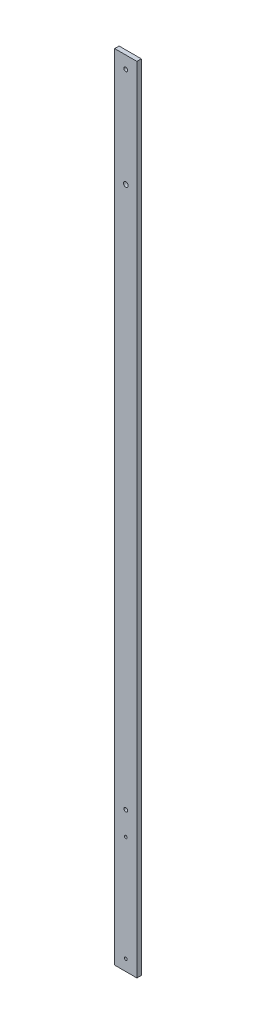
ISO-10303-21;
HEADER;
FILE_DESCRIPTION(('STEP AP214'),'2;1');
FILE_NAME('part.step','',(''),(''),'','','');
FILE_SCHEMA(('AUTOMOTIVE_DESIGN { 1 0 10303 214 1 1 1 1 }'));
ENDSEC;
DATA;
#1=APPLICATION_CONTEXT('core data for automotive mechanical design processes');
#2=APPLICATION_PROTOCOL_DEFINITION('international standard','automotive_design',2000,#1);
#3=PRODUCT_CONTEXT('',#1,'mechanical');
#4=PRODUCT('Part','Part','',(#3));
#5=PRODUCT_RELATED_PRODUCT_CATEGORY('part','',(#4));
#6=PRODUCT_DEFINITION_FORMATION('','',#4);
#7=PRODUCT_DEFINITION_CONTEXT('part definition',#1,'design');
#8=PRODUCT_DEFINITION('design','',#6,#7);
#9=PRODUCT_DEFINITION_SHAPE('','',#8);
#10=(LENGTH_UNIT() NAMED_UNIT(*) SI_UNIT(.MILLI.,.METRE.));
#11=(NAMED_UNIT(*) PLANE_ANGLE_UNIT() SI_UNIT($,.RADIAN.));
#12=(NAMED_UNIT(*) SI_UNIT($,.STERADIAN.) SOLID_ANGLE_UNIT());
#13=UNCERTAINTY_MEASURE_WITH_UNIT(LENGTH_MEASURE(1.E-05),#10,'distance_accuracy_value','');
#14=(GEOMETRIC_REPRESENTATION_CONTEXT(3) GLOBAL_UNCERTAINTY_ASSIGNED_CONTEXT((#13)) GLOBAL_UNIT_ASSIGNED_CONTEXT((#10,
#11,#12)) REPRESENTATION_CONTEXT('',''));
#15=CARTESIAN_POINT('',(0.,0.,0.));
#16=DIRECTION('',(0.,0.,1.));
#17=DIRECTION('',(1.,0.,0.));
#18=AXIS2_PLACEMENT_3D('',#15,#16,#17);
#19=CARTESIAN_POINT('',(40.,0.,0.));
#20=DIRECTION('',(0.,0.,1.));
#21=DIRECTION('',(1.,0.,0.));
#22=AXIS2_PLACEMENT_3D('',#19,#20,#21);
#23=PLANE('',#22);
#24=CARTESIAN_POINT('',(20.,210.,0.));
#25=DIRECTION('',(0.,0.,1.));
#26=DIRECTION('',(1.,0.,0.));
#27=AXIS2_PLACEMENT_3D('',#24,#25,#26);
#28=CIRCLE('',#27,2.49999999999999);
#29=CARTESIAN_POINT('',(22.5,210.,0.));
#30=VERTEX_POINT('',#29);
#31=EDGE_CURVE('E147',#30,#30,#28,.T.);
#32=ORIENTED_EDGE('',*,*,#31,.F.);
#33=EDGE_LOOP('',(#32));
#34=FACE_BOUND('',#33,.T.);
#35=CARTESIAN_POINT('',(20.,20.,0.));
#36=DIRECTION('',(0.,0.,1.));
#37=DIRECTION('',(1.,0.,0.));
#38=AXIS2_PLACEMENT_3D('',#35,#36,#37);
#39=CIRCLE('',#38,2.49999999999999);
#40=CARTESIAN_POINT('',(22.5,20.,0.));
#41=VERTEX_POINT('',#40);
#42=EDGE_CURVE('E151',#41,#41,#39,.T.);
#43=ORIENTED_EDGE('',*,*,#42,.F.);
#44=EDGE_LOOP('',(#43));
#45=FACE_BOUND('',#44,.T.);
#46=CARTESIAN_POINT('',(20.,1228.,0.));
#47=DIRECTION('',(0.,0.,-1.));
#48=DIRECTION('',(-1.,0.,0.));
#49=AXIS2_PLACEMENT_3D('',#46,#47,#48);
#50=CIRCLE('',#49,4.25);
#51=CARTESIAN_POINT('',(15.75,1228.,0.));
#52=VERTEX_POINT('',#51);
#53=EDGE_CURVE('E155',#52,#52,#50,.T.);
#54=ORIENTED_EDGE('',*,*,#53,.T.);
#55=EDGE_LOOP('',(#54));
#56=FACE_BOUND('',#55,.T.);
#57=CARTESIAN_POINT('',(20.,252.5,0.));
#58=DIRECTION('',(0.,0.,-1.));
#59=DIRECTION('',(-1.,0.,0.));
#60=AXIS2_PLACEMENT_3D('',#57,#58,#59);
#61=CIRCLE('',#60,3.39999999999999);
#62=CARTESIAN_POINT('',(16.6,252.5,0.));
#63=VERTEX_POINT('',#62);
#64=EDGE_CURVE('E158',#63,#63,#61,.T.);
#65=ORIENTED_EDGE('',*,*,#64,.T.);
#66=EDGE_LOOP('',(#65));
#67=FACE_BOUND('',#66,.T.);
#68=DIRECTION('',(0.,1.,0.));
#69=VECTOR('',#68,1.);
#70=CARTESIAN_POINT('',(0.,0.,0.));
#71=LINE('',#70,#69);
#72=CARTESIAN_POINT('',(0.,0.,0.));
#73=VERTEX_POINT('',#72);
#74=CARTESIAN_POINT('',(0.,1430.,0.));
#75=VERTEX_POINT('',#74);
#76=EDGE_CURVE('E98',#73,#75,#71,.T.);
#77=ORIENTED_EDGE('',*,*,#76,.F.);
#78=DIRECTION('',(-1.,0.,0.));
#79=VECTOR('',#78,1.);
#80=CARTESIAN_POINT('',(40.,0.,0.));
#81=LINE('',#80,#79);
#82=CARTESIAN_POINT('',(40.,0.,0.));
#83=VERTEX_POINT('',#82);
#84=EDGE_CURVE('E62',#83,#73,#81,.T.);
#85=ORIENTED_EDGE('',*,*,#84,.F.);
#86=DIRECTION('',(0.,1.,0.));
#87=VECTOR('',#86,1.);
#88=CARTESIAN_POINT('',(40.,0.,0.));
#89=LINE('',#88,#87);
#90=CARTESIAN_POINT('',(40.,1430.,0.));
#91=VERTEX_POINT('',#90);
#92=EDGE_CURVE('E114',#83,#91,#89,.T.);
#93=ORIENTED_EDGE('',*,*,#92,.T.);
#94=DIRECTION('',(-1.,0.,0.));
#95=VECTOR('',#94,1.);
#96=CARTESIAN_POINT('',(40.,1430.,0.));
#97=LINE('',#96,#95);
#98=EDGE_CURVE('E47',#91,#75,#97,.T.);
#99=ORIENTED_EDGE('',*,*,#98,.T.);
#100=EDGE_LOOP('',(#77,#85,#93,#99));
#101=FACE_BOUND('',#100,.T.);
#102=CARTESIAN_POINT('',(20.,1407.5,0.));
#103=DIRECTION('',(0.,0.,-1.));
#104=DIRECTION('',(-1.,0.,0.));
#105=AXIS2_PLACEMENT_3D('',#102,#103,#104);
#106=CIRCLE('',#105,3.39999999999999);
#107=CARTESIAN_POINT('',(16.6,1407.5,0.));
#108=VERTEX_POINT('',#107);
#109=EDGE_CURVE('E166',#108,#108,#106,.T.);
#110=ORIENTED_EDGE('',*,*,#109,.T.);
#111=EDGE_LOOP('',(#110));
#112=FACE_BOUND('',#111,.T.);
#113=ADVANCED_FACE('F38',(#34,#45,#56,#67,#101,#112),#23,.T.);
#114=CARTESIAN_POINT('',(40.,0.,-8.));
#115=DIRECTION('',(0.,0.,1.));
#116=DIRECTION('',(1.,0.,0.));
#117=AXIS2_PLACEMENT_3D('',#114,#115,#116);
#118=PLANE('',#117);
#119=CARTESIAN_POINT('',(20.,210.,-8.));
#120=DIRECTION('',(0.,0.,1.));
#121=DIRECTION('',(1.,0.,0.));
#122=AXIS2_PLACEMENT_3D('',#119,#120,#121);
#123=CIRCLE('',#122,2.5);
#124=CARTESIAN_POINT('',(22.5,210.,-8.));
#125=VERTEX_POINT('',#124);
#126=EDGE_CURVE('E210',#125,#125,#123,.T.);
#127=ORIENTED_EDGE('',*,*,#126,.T.);
#128=EDGE_LOOP('',(#127));
#129=FACE_BOUND('',#128,.T.);
#130=CARTESIAN_POINT('',(20.,20.,-8.));
#131=DIRECTION('',(0.,0.,1.));
#132=DIRECTION('',(1.,0.,0.));
#133=AXIS2_PLACEMENT_3D('',#130,#131,#132);
#134=CIRCLE('',#133,2.5);
#135=CARTESIAN_POINT('',(22.5,20.,-8.));
#136=VERTEX_POINT('',#135);
#137=EDGE_CURVE('E215',#136,#136,#134,.T.);
#138=ORIENTED_EDGE('',*,*,#137,.T.);
#139=EDGE_LOOP('',(#138));
#140=FACE_BOUND('',#139,.T.);
#141=CARTESIAN_POINT('',(20.,1228.,-8.));
#142=DIRECTION('',(0.,0.,-1.));
#143=DIRECTION('',(-1.,0.,0.));
#144=AXIS2_PLACEMENT_3D('',#141,#142,#143);
#145=CIRCLE('',#144,4.24999999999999);
#146=CARTESIAN_POINT('',(15.75,1228.,-8.));
#147=VERTEX_POINT('',#146);
#148=EDGE_CURVE('E169',#147,#147,#145,.T.);
#149=ORIENTED_EDGE('',*,*,#148,.F.);
#150=EDGE_LOOP('',(#149));
#151=FACE_BOUND('',#150,.T.);
#152=CARTESIAN_POINT('',(20.,252.5,-8.));
#153=DIRECTION('',(0.,0.,-1.));
#154=DIRECTION('',(-1.,0.,0.));
#155=AXIS2_PLACEMENT_3D('',#152,#153,#154);
#156=CIRCLE('',#155,3.39999999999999);
#157=CARTESIAN_POINT('',(16.6,252.5,-8.));
#158=VERTEX_POINT('',#157);
#159=EDGE_CURVE('E161',#158,#158,#156,.T.);
#160=ORIENTED_EDGE('',*,*,#159,.F.);
#161=EDGE_LOOP('',(#160));
#162=FACE_BOUND('',#161,.T.);
#163=CARTESIAN_POINT('',(20.,1407.5,-8.));
#164=DIRECTION('',(0.,0.,-1.));
#165=DIRECTION('',(-1.,0.,0.));
#166=AXIS2_PLACEMENT_3D('',#163,#164,#165);
#167=CIRCLE('',#166,3.39999999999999);
#168=CARTESIAN_POINT('',(16.6,1407.5,-8.));
#169=VERTEX_POINT('',#168);
#170=EDGE_CURVE('E95',#169,#169,#167,.T.);
#171=ORIENTED_EDGE('',*,*,#170,.F.);
#172=EDGE_LOOP('',(#171));
#173=FACE_BOUND('',#172,.T.);
#174=DIRECTION('',(0.,1.,0.));
#175=VECTOR('',#174,1.);
#176=CARTESIAN_POINT('',(0.,0.,-8.));
#177=LINE('',#176,#175);
#178=CARTESIAN_POINT('',(0.,0.,-8.));
#179=VERTEX_POINT('',#178);
#180=CARTESIAN_POINT('',(0.,1430.,-8.));
#181=VERTEX_POINT('',#180);
#182=EDGE_CURVE('E91',#179,#181,#177,.T.);
#183=ORIENTED_EDGE('',*,*,#182,.T.);
#184=DIRECTION('',(-1.,0.,0.));
#185=VECTOR('',#184,1.);
#186=CARTESIAN_POINT('',(40.,1430.,-8.));
#187=LINE('',#186,#185);
#188=CARTESIAN_POINT('',(40.,1430.,-8.));
#189=VERTEX_POINT('',#188);
#190=EDGE_CURVE('E11',#189,#181,#187,.T.);
#191=ORIENTED_EDGE('',*,*,#190,.F.);
#192=DIRECTION('',(0.,1.,0.));
#193=VECTOR('',#192,1.);
#194=CARTESIAN_POINT('',(40.,0.,-8.));
#195=LINE('',#194,#193);
#196=CARTESIAN_POINT('',(40.,0.,-8.));
#197=VERTEX_POINT('',#196);
#198=EDGE_CURVE('E109',#197,#189,#195,.T.);
#199=ORIENTED_EDGE('',*,*,#198,.F.);
#200=DIRECTION('',(-1.,0.,0.));
#201=VECTOR('',#200,1.);
#202=CARTESIAN_POINT('',(40.,0.,-8.));
#203=LINE('',#202,#201);
#204=EDGE_CURVE('E54',#197,#179,#203,.T.);
#205=ORIENTED_EDGE('',*,*,#204,.T.);
#206=EDGE_LOOP('',(#183,#191,#199,#205));
#207=FACE_BOUND('',#206,.T.);
#208=ADVANCED_FACE('F40',(#129,#140,#151,#162,#173,#207),#118,.F.);
#209=CARTESIAN_POINT('',(40.,1430.,0.));
#210=DIRECTION('',(0.,1.,0.));
#211=DIRECTION('',(0.,0.,1.));
#212=AXIS2_PLACEMENT_3D('',#209,#210,#211);
#213=PLANE('',#212);
#214=DIRECTION('',(0.,0.,-1.));
#215=VECTOR('',#214,1.);
#216=CARTESIAN_POINT('',(0.,1430.,0.));
#217=LINE('',#216,#215);
#218=EDGE_CURVE('E85',#75,#181,#217,.T.);
#219=ORIENTED_EDGE('',*,*,#218,.F.);
#220=ORIENTED_EDGE('',*,*,#98,.F.);
#221=DIRECTION('',(0.,0.,-1.));
#222=VECTOR('',#221,1.);
#223=CARTESIAN_POINT('',(40.,1430.,0.));
#224=LINE('',#223,#222);
#225=EDGE_CURVE('E88',#91,#189,#224,.T.);
#226=ORIENTED_EDGE('',*,*,#225,.T.);
#227=ORIENTED_EDGE('',*,*,#190,.T.);
#228=EDGE_LOOP('',(#219,#220,#226,#227));
#229=FACE_BOUND('',#228,.T.);
#230=ADVANCED_FACE('F83',(#229),#213,.T.);
#231=CARTESIAN_POINT('',(40.,0.,-8.));
#232=DIRECTION('',(0.,-1.,0.));
#233=DIRECTION('',(0.,0.,-1.));
#234=AXIS2_PLACEMENT_3D('',#231,#232,#233);
#235=PLANE('',#234);
#236=DIRECTION('',(0.,0.,1.));
#237=VECTOR('',#236,1.);
#238=CARTESIAN_POINT('',(0.,0.,-8.));
#239=LINE('',#238,#237);
#240=EDGE_CURVE('E104',#179,#73,#239,.T.);
#241=ORIENTED_EDGE('',*,*,#240,.F.);
#242=ORIENTED_EDGE('',*,*,#204,.F.);
#243=DIRECTION('',(0.,0.,1.));
#244=VECTOR('',#243,1.);
#245=CARTESIAN_POINT('',(40.,0.,-8.));
#246=LINE('',#245,#244);
#247=EDGE_CURVE('E117',#197,#83,#246,.T.);
#248=ORIENTED_EDGE('',*,*,#247,.T.);
#249=ORIENTED_EDGE('',*,*,#84,.T.);
#250=EDGE_LOOP('',(#241,#242,#248,#249));
#251=FACE_BOUND('',#250,.T.);
#252=ADVANCED_FACE('F129',(#251),#235,.T.);
#253=CARTESIAN_POINT('',(40.,1430.,-8.));
#254=DIRECTION('',(-1.,0.,0.));
#255=DIRECTION('',(0.,0.,1.));
#256=AXIS2_PLACEMENT_3D('',#253,#254,#255);
#257=PLANE('',#256);
#258=ORIENTED_EDGE('',*,*,#198,.T.);
#259=ORIENTED_EDGE('',*,*,#225,.F.);
#260=ORIENTED_EDGE('',*,*,#92,.F.);
#261=ORIENTED_EDGE('',*,*,#247,.F.);
#262=EDGE_LOOP('',(#258,#259,#260,#261));
#263=FACE_BOUND('',#262,.T.);
#264=ADVANCED_FACE('F127',(#263),#257,.F.);
#265=CARTESIAN_POINT('',(0.,1430.,-8.));
#266=DIRECTION('',(-1.,0.,0.));
#267=DIRECTION('',(0.,0.,1.));
#268=AXIS2_PLACEMENT_3D('',#265,#266,#267);
#269=PLANE('',#268);
#270=ORIENTED_EDGE('',*,*,#182,.F.);
#271=ORIENTED_EDGE('',*,*,#240,.T.);
#272=ORIENTED_EDGE('',*,*,#76,.T.);
#273=ORIENTED_EDGE('',*,*,#218,.T.);
#274=EDGE_LOOP('',(#270,#271,#272,#273));
#275=FACE_BOUND('',#274,.T.);
#276=ADVANCED_FACE('F97',(#275),#269,.T.);
#277=CARTESIAN_POINT('',(20.,1407.5,-8.));
#278=DIRECTION('',(0.,0.,-1.));
#279=DIRECTION('',(-1.,0.,0.));
#280=AXIS2_PLACEMENT_3D('',#277,#278,#279);
#281=CYLINDRICAL_SURFACE('',#280,3.39999999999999);
#282=ORIENTED_EDGE('',*,*,#109,.F.);
#283=EDGE_LOOP('',(#282));
#284=FACE_BOUND('',#283,.T.);
#285=ORIENTED_EDGE('',*,*,#170,.T.);
#286=EDGE_LOOP('',(#285));
#287=FACE_BOUND('',#286,.T.);
#288=ADVANCED_FACE('F180',(#284,#287),#281,.F.);
#289=CARTESIAN_POINT('',(20.,252.5,-8.));
#290=DIRECTION('',(0.,0.,-1.));
#291=DIRECTION('',(-1.,0.,0.));
#292=AXIS2_PLACEMENT_3D('',#289,#290,#291);
#293=CYLINDRICAL_SURFACE('',#292,3.39999999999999);
#294=ORIENTED_EDGE('',*,*,#64,.F.);
#295=EDGE_LOOP('',(#294));
#296=FACE_BOUND('',#295,.T.);
#297=ORIENTED_EDGE('',*,*,#159,.T.);
#298=EDGE_LOOP('',(#297));
#299=FACE_BOUND('',#298,.T.);
#300=ADVANCED_FACE('F183',(#296,#299),#293,.F.);
#301=CARTESIAN_POINT('',(20.,1228.,-8.));
#302=DIRECTION('',(0.,0.,-1.));
#303=DIRECTION('',(-1.,0.,0.));
#304=AXIS2_PLACEMENT_3D('',#301,#302,#303);
#305=CYLINDRICAL_SURFACE('',#304,4.24999999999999);
#306=ORIENTED_EDGE('',*,*,#53,.F.);
#307=EDGE_LOOP('',(#306));
#308=FACE_BOUND('',#307,.T.);
#309=ORIENTED_EDGE('',*,*,#148,.T.);
#310=EDGE_LOOP('',(#309));
#311=FACE_BOUND('',#310,.T.);
#312=ADVANCED_FACE('F190',(#308,#311),#305,.F.);
#313=CARTESIAN_POINT('',(20.,20.,0.));
#314=DIRECTION('',(0.,0.,1.));
#315=DIRECTION('',(1.,0.,0.));
#316=AXIS2_PLACEMENT_3D('',#313,#314,#315);
#317=CYLINDRICAL_SURFACE('',#316,2.49999999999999);
#318=ORIENTED_EDGE('',*,*,#137,.F.);
#319=EDGE_LOOP('',(#318));
#320=FACE_BOUND('',#319,.T.);
#321=ORIENTED_EDGE('',*,*,#42,.T.);
#322=EDGE_LOOP('',(#321));
#323=FACE_BOUND('',#322,.T.);
#324=ADVANCED_FACE('F197',(#320,#323),#317,.F.);
#325=CARTESIAN_POINT('',(20.,210.,0.));
#326=DIRECTION('',(0.,0.,1.));
#327=DIRECTION('',(1.,0.,0.));
#328=AXIS2_PLACEMENT_3D('',#325,#326,#327);
#329=CYLINDRICAL_SURFACE('',#328,2.49999999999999);
#330=ORIENTED_EDGE('',*,*,#126,.F.);
#331=EDGE_LOOP('',(#330));
#332=FACE_BOUND('',#331,.T.);
#333=ORIENTED_EDGE('',*,*,#31,.T.);
#334=EDGE_LOOP('',(#333));
#335=FACE_BOUND('',#334,.T.);
#336=ADVANCED_FACE('F201',(#332,#335),#329,.F.);
#337=CLOSED_SHELL('',(#113,#208,#230,#252,#264,#276,#288,#300,#312,#324,#336));
#338=MANIFOLD_SOLID_BREP('B2',#337);
#339=ADVANCED_BREP_SHAPE_REPRESENTATION('',(#18,#338),#14);
#340=SHAPE_DEFINITION_REPRESENTATION(#9,#339);
ENDSEC;
END-ISO-10303-21;
